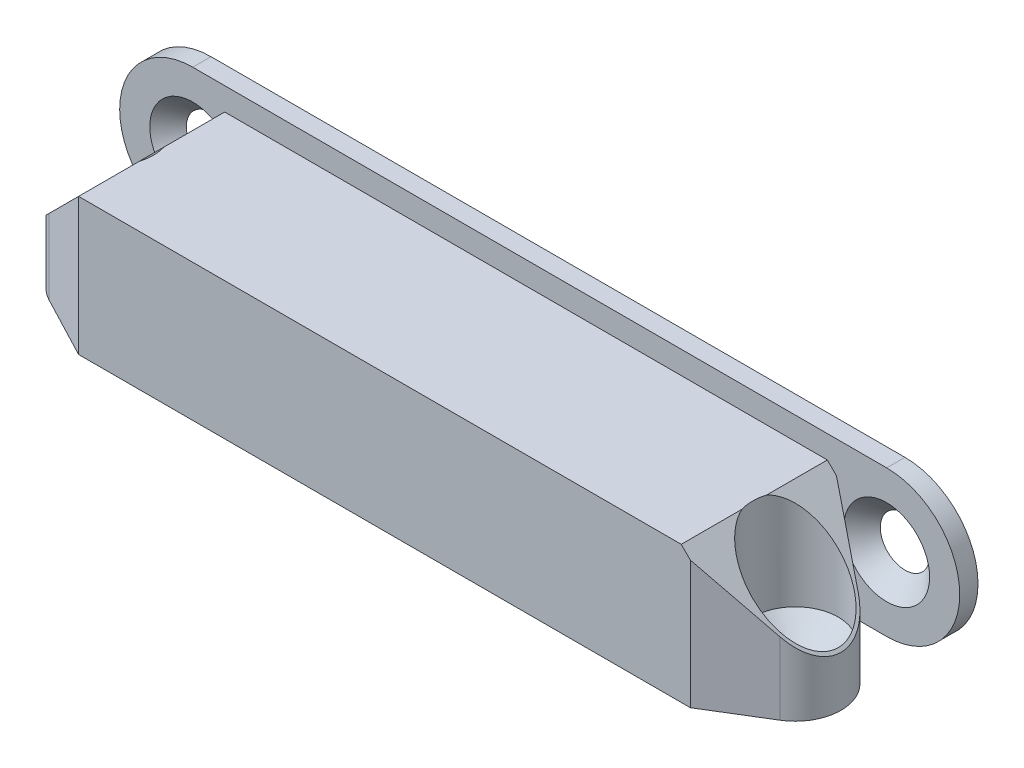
from build123d import *

# Parameters (mm, degrees)
EXTRUSION1_DEPTH                               = 2
FRAISAGE_POUR_VIS_T_TE_FRAIS_E_M41_D           = 4.3
FRAISAGE_POUR_VIS_T_TE_FRAIS_E_M41_DEPTH       = 10
FRAISAGE_POUR_VIS_T_TE_FRAIS_E_M41_CSINK_D     = 9.4
FRAISAGE_POUR_VIS_T_TE_FRAIS_E_M41_CSINK_ANGLE = 90
FRAISAGE_POUR_VIS_T_TE_FRAIS_E_M41_TIP         = 1.291850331
EXTRUSION2_DEPTH                               = 15
ENL_V_MAT_EXTRU_1_DEPTH                        = 17.5


with BuildPart() as part:
    # Esquisse1 → Extrusion1 (new body)
    with BuildSketch(Plane.XY):
        with BuildLine():
            Line((-38, -8), (38, -8))
            ThreePointArc((38, -8), (46, 0), (38, 8))
            Line((38, 8), (-38, 8))
            ThreePointArc((-38, 8), (-46, 0), (-38, -8))
        make_face()
    extrude(amount=EXTRUSION1_DEPTH)

    # Fraisage pour vis _ t_te frais_e M41
    with Locations(Plane.XY.offset(2)):
        with Locations((-38, 0), (38, 0)):
            CounterSinkHole(FRAISAGE_POUR_VIS_T_TE_FRAIS_E_M41_D / 2, FRAISAGE_POUR_VIS_T_TE_FRAIS_E_M41_CSINK_D / 2, depth=FRAISAGE_POUR_VIS_T_TE_FRAIS_E_M41_DEPTH, counter_sink_angle=FRAISAGE_POUR_VIS_T_TE_FRAIS_E_M41_CSINK_ANGLE)
            with Locations((0, 0, -(FRAISAGE_POUR_VIS_T_TE_FRAIS_E_M41_DEPTH + FRAISAGE_POUR_VIS_T_TE_FRAIS_E_M41_TIP / 2))):  # 118° drill point
                Cone(0, FRAISAGE_POUR_VIS_T_TE_FRAIS_E_M41_D / 2, FRAISAGE_POUR_VIS_T_TE_FRAIS_E_M41_TIP, mode=Mode.SUBTRACT)


with BuildPart() as body_2:
    # Esquisse5 → Extrusion2 (new body)
    with BuildSketch(Plane.XZ.offset(8)):
        with BuildLine():
            Line((-33, 3.5), (34, 3.5))
            Line((34, 3.5), (40.107953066, 7.234020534))
            ThreePointArc((40.107953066, 7.234020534), (42.5, 11.5), (40.107953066, 15.765979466))
            Line((40.107953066, 15.765979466), (34, 19.5))
            Line((34, 19.5), (-33, 19.5))
            Line((-33, 19.5), (-39.819241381, 15.929573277))
            ThreePointArc((-39.819241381, 15.929573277), (-42.5, 11.5), (-39.819241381, 7.070426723))
            Line((-39.819241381, 7.070426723), (-33, 3.5))
        make_face()
    extrude(amount=-EXTRUSION2_DEPTH)

    # Esquisse6 → Enl_v. mat.-Extru.1 (cut)
    with BuildSketch(Plane.XY.offset(19.5)):
        Polygon((-33, 7), (-48, -8), (-48, 7), align=None)
    enl_v_mat_extru_1 = extrude(amount=-ENL_V_MAT_EXTRU_1_DEPTH, mode=Mode.SUBTRACT)

    # Esquisse10 → Fraisage pour vis _ t_te frais_e M43 (revolve, cut)
    with BuildSketch(Plane(origin=(-37.5, 7, 11.5), x_dir=(0, 0, 1), z_dir=(1, 0, 0))):
        Polygon((0, 0), (0, 26.291850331), (2.15, 25), (2.15, 13.55), (4.7, 11), (4.7, 0), align=None)
    fraisage_pour_vis_t_te_frais_e_m43 = revolve(axis=Axis((-37.5, 13.35, 11.5), (0, -1, 0)), mode=Mode.SUBTRACT)

    # Sym_trie1: Enl_v. mat.-Extru.1, Fraisage pour vis _ t_te frais_e M43 across plane
    add(enl_v_mat_extru_1.mirror(Plane(origin=(0, 0, 0), x_dir=(0, 0, 1), z_dir=(1, 0, 0))), mode=Mode.SUBTRACT)
    add(fraisage_pour_vis_t_te_frais_e_m43.mirror(Plane(origin=(0, 0, 0), x_dir=(0, 0, 1), z_dir=(1, 0, 0))), mode=Mode.SUBTRACT)


solid = Compound([part.part, body_2.part])
